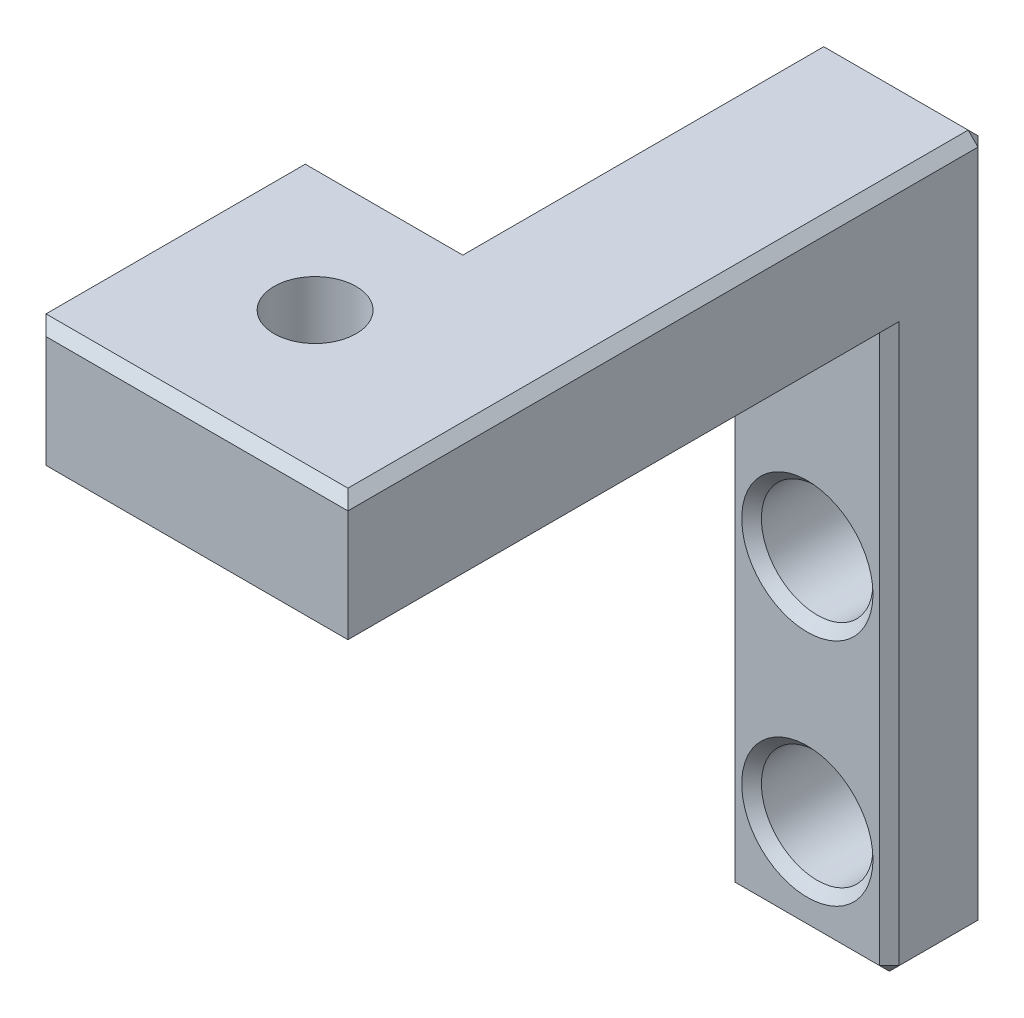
from build123d import *

# Parameters (mm, degrees)
SKETCH_1_W          = 5
SKETCH_1_H          = 21
EXTRUDE_1_DEPTH     = 3
SKETCH_2_W          = 5
SKETCH_2_H          = 4
EXTRUDE_2_DEPTH     = 8
SKETCH_3_W          = 9.5
SKETCH_3_H          = 4
EXTRUDE_3_DEPTH     = 8.5
SKETCH_4_R          = 1.7
CUT_EXTRUDE_1_DEPTH = 8.5
HOLE_WIZARD_M3_1_D  = 2.5
CHAMFER_1_SIZE      = 0.3
CHAMFER_2_SIZE      = 0.3


with BuildPart() as part:
    # Sketch 1 → Extrude 1 (new body)
    with BuildSketch(Plane.XY):
        Rectangle(SKETCH_1_W, SKETCH_1_H)
    extrude(amount=EXTRUDE_1_DEPTH)

    # Sketch 2 → Extrude 2 (add)
    with BuildSketch(Plane.XY.offset(3)):
        with Locations((0, 8.5)):
            Rectangle(SKETCH_2_W, SKETCH_2_H)
    extrude(amount=EXTRUDE_2_DEPTH)

    # Sketch 3 → Extrude 3 (add)
    with BuildSketch(Plane.XY.offset(11)):
        with Locations((-2.25, 8.5)):
            Rectangle(SKETCH_3_W, SKETCH_3_H)
    extrude(amount=EXTRUDE_3_DEPTH)

    # Sketch 4 → Cut-Extrude 1 (cut)
    with BuildSketch(Plane.XY.offset(3)):
        with Locations((0, -0.5)):
            Circle(SKETCH_4_R)
        with Locations((0, -7.5)):
            Circle(SKETCH_4_R)
    extrude(amount=-CUT_EXTRUDE_1_DEPTH, mode=Mode.SUBTRACT)

    # Hole Wizard M3 _1 (through all)
    with Locations(Plane(origin=(0, 6.5, 0), x_dir=(-1, 0, 0), z_dir=(0, -1, 0))):
        with Locations((3, -15)):
            Hole(HOLE_WIZARD_M3_1_D / 2)

    # Chamfer 1
    chamfer_1_edges = [part.edges().sort_by_distance(p)[0] for p in [
        (-2.5, -2, 3),
        (0, -10.5, 3),
        (2.5, -2, 3),
        (0, -10.5, 0),
        (-2.5, 0, 0),
        (0, 10.5, 0),
        (2.5, 0, 0),
        (2.5, -10.5, 1.5),
        (-2.5, -10.5, 1.5),
        (-2.5, 10.5, 5.5),
        (2.5, 10.5, 9.75),
    ]]
    chamfer(chamfer_1_edges, length=CHAMFER_1_SIZE)

    # Chamfer 2
    chamfer_2_edges = [part.edges().sort_by_distance(p)[0] for p in [
        (-1.7, -7.5, 0),
        (-1.7, -0.5, 0),
        (-1.7, -7.5, 3),
        (-1.7, -0.5, 3),
        (-4.6, 10.5, 11),
        (-2.4, 10.5, 19.5),
        (-7, 8.5, 19.5),
        (-7, 8.5, 11),
        (-2.5, 6.5, 6.85),
        (-4.75, 6.5, 11),
        (-7, 6.5, 15.25),
        (-2.25, 6.5, 19.5),
        (2.5, 6.5, 11.1),
    ]]
    chamfer(chamfer_2_edges, length=CHAMFER_2_SIZE)


solid = part.part
